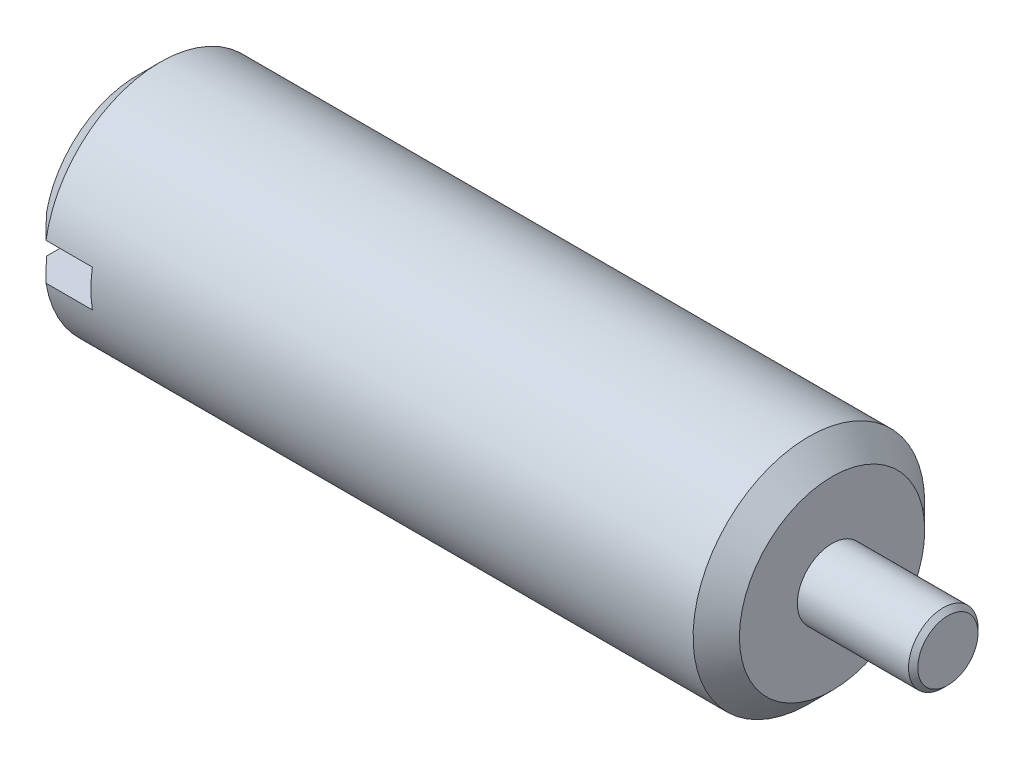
ISO-10303-21;
HEADER;
FILE_DESCRIPTION(('STEP AP214'),'2;1');
FILE_NAME('part.step','',(''),(''),'','','');
FILE_SCHEMA(('AUTOMOTIVE_DESIGN { 1 0 10303 214 1 1 1 1 }'));
ENDSEC;
DATA;
#1=APPLICATION_CONTEXT('core data for automotive mechanical design processes');
#2=APPLICATION_PROTOCOL_DEFINITION('international standard','automotive_design',2000,#1);
#3=PRODUCT_CONTEXT('',#1,'mechanical');
#4=PRODUCT('Part','Part','',(#3));
#5=PRODUCT_RELATED_PRODUCT_CATEGORY('part','',(#4));
#6=PRODUCT_DEFINITION_FORMATION('','',#4);
#7=PRODUCT_DEFINITION_CONTEXT('part definition',#1,'design');
#8=PRODUCT_DEFINITION('design','',#6,#7);
#9=PRODUCT_DEFINITION_SHAPE('','',#8);
#10=(LENGTH_UNIT() NAMED_UNIT(*) SI_UNIT(.MILLI.,.METRE.));
#11=(NAMED_UNIT(*) PLANE_ANGLE_UNIT() SI_UNIT($,.RADIAN.));
#12=(NAMED_UNIT(*) SI_UNIT($,.STERADIAN.) SOLID_ANGLE_UNIT());
#13=UNCERTAINTY_MEASURE_WITH_UNIT(LENGTH_MEASURE(1.E-05),#10,'distance_accuracy_value','');
#14=(GEOMETRIC_REPRESENTATION_CONTEXT(3) GLOBAL_UNCERTAINTY_ASSIGNED_CONTEXT((#13)) GLOBAL_UNIT_ASSIGNED_CONTEXT((#10,
#11,#12)) REPRESENTATION_CONTEXT('',''));
#15=CARTESIAN_POINT('',(0.,0.,0.));
#16=DIRECTION('',(0.,0.,1.));
#17=DIRECTION('',(1.,0.,0.));
#18=AXIS2_PLACEMENT_3D('',#15,#16,#17);
#19=CARTESIAN_POINT('',(30.,0.,0.));
#20=DIRECTION('',(1.,0.,0.));
#21=DIRECTION('',(0.,0.,-1.));
#22=AXIS2_PLACEMENT_3D('',#19,#20,#21);
#23=PLANE('',#22);
#24=CARTESIAN_POINT('',(30.,0.,0.));
#25=DIRECTION('',(1.,0.,0.));
#26=DIRECTION('',(0.,0.,-1.));
#27=AXIS2_PLACEMENT_3D('',#24,#25,#26);
#28=CIRCLE('',#27,4.);
#29=CARTESIAN_POINT('',(30.,0.,-4.00000000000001));
#30=VERTEX_POINT('',#29);
#31=EDGE_CURVE('E193',#30,#30,#28,.T.);
#32=ORIENTED_EDGE('',*,*,#31,.T.);
#33=EDGE_LOOP('',(#32));
#34=FACE_BOUND('',#33,.T.);
#35=CARTESIAN_POINT('',(30.,0.,0.));
#36=DIRECTION('',(1.,0.,0.));
#37=DIRECTION('',(0.,0.,-1.));
#38=AXIS2_PLACEMENT_3D('',#35,#36,#37);
#39=CIRCLE('',#38,1.5);
#40=CARTESIAN_POINT('',(30.,0.,-1.5));
#41=VERTEX_POINT('',#40);
#42=EDGE_CURVE('E103',#41,#41,#39,.T.);
#43=ORIENTED_EDGE('',*,*,#42,.F.);
#44=EDGE_LOOP('',(#43));
#45=FACE_BOUND('',#44,.T.);
#46=ADVANCED_FACE('F25',(#34,#45),#23,.T.);
#47=CARTESIAN_POINT('',(0.,0.,0.));
#48=DIRECTION('',(1.,0.,0.));
#49=DIRECTION('',(0.,0.,-1.));
#50=AXIS2_PLACEMENT_3D('',#47,#48,#49);
#51=PLANE('',#50);
#52=DIRECTION('',(0.,0.,1.));
#53=VECTOR('',#52,1.);
#54=CARTESIAN_POINT('',(0.,0.800000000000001,0.));
#55=LINE('',#54,#53);
#56=CARTESIAN_POINT('',(0.,0.800000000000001,-3.91918358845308));
#57=VERTEX_POINT('',#56);
#58=CARTESIAN_POINT('',(0.,0.800000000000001,3.91918358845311));
#59=VERTEX_POINT('',#58);
#60=EDGE_CURVE('E117',#57,#59,#55,.T.);
#61=ORIENTED_EDGE('',*,*,#60,.T.);
#62=CARTESIAN_POINT('',(0.,0.,0.));
#63=DIRECTION('',(1.,0.,0.));
#64=DIRECTION('',(0.,0.,-1.));
#65=AXIS2_PLACEMENT_3D('',#62,#63,#64);
#66=CIRCLE('',#65,3.99999999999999);
#67=EDGE_CURVE('E46',#59,#57,#66,.F.);
#68=ORIENTED_EDGE('',*,*,#67,.T.);
#69=EDGE_LOOP('',(#61,#68));
#70=FACE_BOUND('',#69,.T.);
#71=ADVANCED_FACE('F185',(#70),#51,.F.);
#72=CARTESIAN_POINT('',(30.,0.,0.));
#73=DIRECTION('',(-1.,0.,0.));
#74=DIRECTION('',(0.,0.,1.));
#75=AXIS2_PLACEMENT_3D('',#72,#73,#74);
#76=CYLINDRICAL_SURFACE('',#75,5.);
#77=CARTESIAN_POINT('',(29.,0.,0.));
#78=DIRECTION('',(1.,0.,0.));
#79=DIRECTION('',(0.,0.,-1.));
#80=AXIS2_PLACEMENT_3D('',#77,#78,#79);
#81=CIRCLE('',#80,5.);
#82=CARTESIAN_POINT('',(29.,0.,-5.00000000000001));
#83=VERTEX_POINT('',#82);
#84=EDGE_CURVE('E197',#83,#83,#81,.F.);
#85=ORIENTED_EDGE('',*,*,#84,.T.);
#86=EDGE_LOOP('',(#85));
#87=FACE_BOUND('',#86,.T.);
#88=DIRECTION('',(-1.,0.,0.));
#89=VECTOR('',#88,1.);
#90=CARTESIAN_POINT('',(30.,-0.800000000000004,4.93558507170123));
#91=LINE('',#90,#89);
#92=CARTESIAN_POINT('',(2.99999999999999,-0.800000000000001,4.93558507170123));
#93=VERTEX_POINT('',#92);
#94=CARTESIAN_POINT('',(1.,-0.800000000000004,4.93558507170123));
#95=VERTEX_POINT('',#94);
#96=EDGE_CURVE('E88',#93,#95,#91,.T.);
#97=ORIENTED_EDGE('',*,*,#96,.T.);
#98=CARTESIAN_POINT('',(1.,0.,0.));
#99=DIRECTION('',(1.,0.,0.));
#100=DIRECTION('',(0.,0.,-1.));
#101=AXIS2_PLACEMENT_3D('',#98,#99,#100);
#102=CIRCLE('',#101,5.);
#103=CARTESIAN_POINT('',(1.,-0.800000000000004,-4.93558507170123));
#104=VERTEX_POINT('',#103);
#105=EDGE_CURVE('E85',#95,#104,#102,.T.);
#106=ORIENTED_EDGE('',*,*,#105,.T.);
#107=DIRECTION('',(-1.,0.,0.));
#108=VECTOR('',#107,1.);
#109=CARTESIAN_POINT('',(30.,-0.800000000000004,-4.93558507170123));
#110=LINE('',#109,#108);
#111=CARTESIAN_POINT('',(3.,-0.800000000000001,-4.93558507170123));
#112=VERTEX_POINT('',#111);
#113=EDGE_CURVE('E78',#104,#112,#110,.F.);
#114=ORIENTED_EDGE('',*,*,#113,.T.);
#115=CARTESIAN_POINT('',(3.,0.,0.));
#116=DIRECTION('',(1.,0.,0.));
#117=DIRECTION('',(0.,0.,-1.));
#118=AXIS2_PLACEMENT_3D('',#115,#116,#117);
#119=CIRCLE('',#118,5.);
#120=CARTESIAN_POINT('',(3.,0.800000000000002,-4.93558507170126));
#121=VERTEX_POINT('',#120);
#122=EDGE_CURVE('E82',#112,#121,#119,.T.);
#123=ORIENTED_EDGE('',*,*,#122,.T.);
#124=DIRECTION('',(-1.,0.,0.));
#125=VECTOR('',#124,1.);
#126=CARTESIAN_POINT('',(30.,0.800000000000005,-4.93558507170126));
#127=LINE('',#126,#125);
#128=CARTESIAN_POINT('',(1.,0.800000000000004,-4.93558507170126));
#129=VERTEX_POINT('',#128);
#130=EDGE_CURVE('E112',#121,#129,#127,.T.);
#131=ORIENTED_EDGE('',*,*,#130,.T.);
#132=CARTESIAN_POINT('',(1.,0.,0.));
#133=DIRECTION('',(1.,0.,0.));
#134=DIRECTION('',(0.,0.,-1.));
#135=AXIS2_PLACEMENT_3D('',#132,#133,#134);
#136=CIRCLE('',#135,5.);
#137=CARTESIAN_POINT('',(1.,0.800000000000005,4.93558507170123));
#138=VERTEX_POINT('',#137);
#139=EDGE_CURVE('E99',#129,#138,#136,.T.);
#140=ORIENTED_EDGE('',*,*,#139,.T.);
#141=DIRECTION('',(-1.,0.,0.));
#142=VECTOR('',#141,1.);
#143=CARTESIAN_POINT('',(30.,0.800000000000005,4.93558507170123));
#144=LINE('',#143,#142);
#145=CARTESIAN_POINT('',(2.99999999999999,0.800000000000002,4.93558507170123));
#146=VERTEX_POINT('',#145);
#147=EDGE_CURVE('E110',#138,#146,#144,.F.);
#148=ORIENTED_EDGE('',*,*,#147,.T.);
#149=EDGE_CURVE('E100',#146,#93,#119,.T.);
#150=ORIENTED_EDGE('',*,*,#149,.T.);
#151=EDGE_LOOP('',(#97,#106,#114,#123,#131,#140,#148,#150));
#152=FACE_BOUND('',#151,.T.);
#153=ADVANCED_FACE('F27',(#87,#152),#76,.T.);
#154=DIRECTION('',(0.,0.,-1.));
#155=VECTOR('',#154,1.);
#156=CARTESIAN_POINT('',(0.,-0.800000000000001,0.));
#157=LINE('',#156,#155);
#158=CARTESIAN_POINT('',(0.,-0.800000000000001,3.91918358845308));
#159=VERTEX_POINT('',#158);
#160=CARTESIAN_POINT('',(0.,-0.800000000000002,-3.91918358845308));
#161=VERTEX_POINT('',#160);
#162=EDGE_CURVE('E114',#159,#161,#157,.T.);
#163=ORIENTED_EDGE('',*,*,#162,.T.);
#164=CARTESIAN_POINT('',(0.,0.,0.));
#165=DIRECTION('',(1.,0.,0.));
#166=DIRECTION('',(0.,0.,-1.));
#167=AXIS2_PLACEMENT_3D('',#164,#165,#166);
#168=CIRCLE('',#167,3.99999999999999);
#169=EDGE_CURVE('E214',#161,#159,#168,.F.);
#170=ORIENTED_EDGE('',*,*,#169,.T.);
#171=EDGE_LOOP('',(#163,#170));
#172=FACE_BOUND('',#171,.T.);
#173=ADVANCED_FACE('F146',(#172),#51,.F.);
#174=CARTESIAN_POINT('',(3.,0.800000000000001,-5.));
#175=DIRECTION('',(1.,0.,0.));
#176=DIRECTION('',(0.,0.,-1.));
#177=AXIS2_PLACEMENT_3D('',#174,#175,#176);
#178=PLANE('',#177);
#179=DIRECTION('',(0.,0.,1.));
#180=VECTOR('',#179,1.);
#181=CARTESIAN_POINT('',(3.,0.800000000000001,-5.));
#182=LINE('',#181,#180);
#183=EDGE_CURVE('E89',#121,#146,#182,.T.);
#184=ORIENTED_EDGE('',*,*,#183,.F.);
#185=ORIENTED_EDGE('',*,*,#122,.F.);
#186=DIRECTION('',(0.,0.,1.));
#187=VECTOR('',#186,1.);
#188=CARTESIAN_POINT('',(3.,-0.800000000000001,-5.00000000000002));
#189=LINE('',#188,#187);
#190=EDGE_CURVE('E96',#112,#93,#189,.T.);
#191=ORIENTED_EDGE('',*,*,#190,.T.);
#192=ORIENTED_EDGE('',*,*,#149,.F.);
#193=EDGE_LOOP('',(#184,#185,#191,#192));
#194=FACE_BOUND('',#193,.T.);
#195=ADVANCED_FACE('F94',(#194),#178,.F.);
#196=CARTESIAN_POINT('',(3.,0.800000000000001,-5.));
#197=DIRECTION('',(0.,1.,0.));
#198=DIRECTION('',(-1.,0.,0.));
#199=AXIS2_PLACEMENT_3D('',#196,#197,#198);
#200=PLANE('',#199);
#201=ORIENTED_EDGE('',*,*,#147,.F.);
#202=CARTESIAN_POINT('',(1.,0.800000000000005,4.93558507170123));
#203=CARTESIAN_POINT('',(0.916527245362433,0.800000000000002,4.85102221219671));
#204=CARTESIAN_POINT('',(0.83308161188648,0.800000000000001,4.76643256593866));
#205=CARTESIAN_POINT('',(0.666255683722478,0.800000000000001,4.59718901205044));
#206=CARTESIAN_POINT('',(0.582875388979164,0.800000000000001,4.51253510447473));
#207=CARTESIAN_POINT('',(0.416191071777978,0.800000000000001,4.34315217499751));
#208=CARTESIAN_POINT('',(0.332887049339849,0.800000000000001,4.25842315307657));
#209=CARTESIAN_POINT('',(0.166370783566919,0.800000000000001,4.08887483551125));
#210=CARTESIAN_POINT('',(0.0831585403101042,0.800000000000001,4.0040555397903));
#211=CARTESIAN_POINT('',(0.,0.800000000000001,3.91918358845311));
#212=B_SPLINE_CURVE_WITH_KNOTS('',3,(#202,#203,#204,#205,#206,#207,#208,#209,#210,#211),
.UNSPECIFIED.,.F.,.F.,(4,2,2,2,4),(0.,0.356464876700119,0.712929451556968,1.06939411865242,
1.42585908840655),.UNSPECIFIED.);
#213=EDGE_CURVE('E40',#138,#59,#212,.T.);
#214=ORIENTED_EDGE('',*,*,#213,.T.);
#215=ORIENTED_EDGE('',*,*,#60,.F.);
#216=CARTESIAN_POINT('',(0.,0.800000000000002,-3.91918358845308));
#217=CARTESIAN_POINT('',(0.0831585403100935,0.800000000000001,-4.00405553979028));
#218=CARTESIAN_POINT('',(0.166370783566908,0.800000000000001,-4.08887483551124));
#219=CARTESIAN_POINT('',(0.332887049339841,0.800000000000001,-4.25842315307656));
#220=CARTESIAN_POINT('',(0.416191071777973,0.800000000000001,-4.34315217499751));
#221=CARTESIAN_POINT('',(0.582875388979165,0.800000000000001,-4.51253510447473));
#222=CARTESIAN_POINT('',(0.666255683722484,0.800000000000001,-4.59718901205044));
#223=CARTESIAN_POINT('',(0.833081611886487,0.800000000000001,-4.76643256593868));
#224=CARTESIAN_POINT('',(0.916527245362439,0.800000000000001,-4.85102221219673));
#225=CARTESIAN_POINT('',(1.,0.800000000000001,-4.93558507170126));
#226=B_SPLINE_CURVE_WITH_KNOTS('',3,(#216,#217,#218,#219,#220,#221,#222,#223,#224,#225),
.UNSPECIFIED.,.F.,.F.,(4,2,2,2,4),(0.,0.356464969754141,0.712929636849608,1.06939421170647,
1.4258590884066),.UNSPECIFIED.);
#227=EDGE_CURVE('E149',#57,#129,#226,.T.);
#228=ORIENTED_EDGE('',*,*,#227,.T.);
#229=ORIENTED_EDGE('',*,*,#130,.F.);
#230=ORIENTED_EDGE('',*,*,#183,.T.);
#231=EDGE_LOOP('',(#201,#214,#215,#228,#229,#230));
#232=FACE_BOUND('',#231,.T.);
#233=ADVANCED_FACE('F141',(#232),#200,.F.);
#234=CARTESIAN_POINT('',(3.,-0.800000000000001,-5.00000000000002));
#235=DIRECTION('',(0.,-1.,0.));
#236=DIRECTION('',(1.,0.,0.));
#237=AXIS2_PLACEMENT_3D('',#234,#235,#236);
#238=PLANE('',#237);
#239=ORIENTED_EDGE('',*,*,#113,.F.);
#240=CARTESIAN_POINT('',(1.,-0.800000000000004,-4.93558507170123));
#241=CARTESIAN_POINT('',(0.916527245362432,-0.800000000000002,-4.85102221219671));
#242=CARTESIAN_POINT('',(0.833081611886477,-0.800000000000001,-4.76643256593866));
#243=CARTESIAN_POINT('',(0.666255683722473,-0.8,-4.59718901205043));
#244=CARTESIAN_POINT('',(0.582875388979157,-0.800000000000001,-4.51253510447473));
#245=CARTESIAN_POINT('',(0.416191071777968,-0.800000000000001,-4.3431521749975));
#246=CARTESIAN_POINT('',(0.332887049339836,-0.800000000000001,-4.25842315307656));
#247=CARTESIAN_POINT('',(0.166370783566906,-0.800000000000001,-4.08887483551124));
#248=CARTESIAN_POINT('',(0.0831585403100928,-0.800000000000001,-4.00405553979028));
#249=CARTESIAN_POINT('',(0.,-0.800000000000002,-3.91918358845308));
#250=B_SPLINE_CURVE_WITH_KNOTS('',3,(#240,#241,#242,#243,#244,#245,#246,#247,#248,#249),
.UNSPECIFIED.,.F.,.F.,(4,2,2,2,4),(0.,0.356464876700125,0.712929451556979,1.06939411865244,
1.42585908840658),.UNSPECIFIED.);
#251=EDGE_CURVE('E129',#104,#161,#250,.T.);
#252=ORIENTED_EDGE('',*,*,#251,.T.);
#253=ORIENTED_EDGE('',*,*,#162,.F.);
#254=CARTESIAN_POINT('',(0.,-0.800000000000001,3.91918358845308));
#255=CARTESIAN_POINT('',(0.0831585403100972,-0.800000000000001,4.00405553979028));
#256=CARTESIAN_POINT('',(0.16637078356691,-0.800000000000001,4.08887483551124));
#257=CARTESIAN_POINT('',(0.332887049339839,-0.800000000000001,4.25842315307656));
#258=CARTESIAN_POINT('',(0.416191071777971,-0.800000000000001,4.34315217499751));
#259=CARTESIAN_POINT('',(0.58287538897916,-0.800000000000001,4.51253510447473));
#260=CARTESIAN_POINT('',(0.666255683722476,-0.800000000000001,4.59718901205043));
#261=CARTESIAN_POINT('',(0.833081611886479,-0.800000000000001,4.76643256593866));
#262=CARTESIAN_POINT('',(0.916527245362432,-0.800000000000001,4.85102221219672));
#263=CARTESIAN_POINT('',(0.999999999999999,-0.800000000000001,4.93558507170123));
#264=B_SPLINE_CURVE_WITH_KNOTS('',3,(#254,#255,#256,#257,#258,#259,#260,#261,#262,#263),
.UNSPECIFIED.,.F.,.F.,(4,2,2,2,4),(0.,0.356464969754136,0.712929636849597,1.06939421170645,
1.42585908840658),.UNSPECIFIED.);
#265=EDGE_CURVE('E122',#159,#95,#264,.T.);
#266=ORIENTED_EDGE('',*,*,#265,.T.);
#267=ORIENTED_EDGE('',*,*,#96,.F.);
#268=ORIENTED_EDGE('',*,*,#190,.F.);
#269=EDGE_LOOP('',(#239,#252,#253,#266,#267,#268));
#270=FACE_BOUND('',#269,.T.);
#271=ADVANCED_FACE('F102',(#270),#238,.F.);
#272=CARTESIAN_POINT('',(1.,0.,0.));
#273=DIRECTION('',(1.,0.,0.));
#274=DIRECTION('',(0.,0.,-1.));
#275=AXIS2_PLACEMENT_3D('',#272,#273,#274);
#276=CONICAL_SURFACE('',#275,5.,0.785398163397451);
#277=ORIENTED_EDGE('',*,*,#265,.F.);
#278=ORIENTED_EDGE('',*,*,#169,.F.);
#279=ORIENTED_EDGE('',*,*,#251,.F.);
#280=ORIENTED_EDGE('',*,*,#105,.F.);
#281=EDGE_LOOP('',(#277,#278,#279,#280));
#282=FACE_BOUND('',#281,.T.);
#283=ADVANCED_FACE('F134',(#282),#276,.T.);
#284=CARTESIAN_POINT('',(1.,0.,0.));
#285=DIRECTION('',(1.,0.,0.));
#286=DIRECTION('',(0.,0.,-1.));
#287=AXIS2_PLACEMENT_3D('',#284,#285,#286);
#288=CONICAL_SURFACE('',#287,5.,0.785398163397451);
#289=ORIENTED_EDGE('',*,*,#227,.F.);
#290=ORIENTED_EDGE('',*,*,#67,.F.);
#291=ORIENTED_EDGE('',*,*,#213,.F.);
#292=ORIENTED_EDGE('',*,*,#139,.F.);
#293=EDGE_LOOP('',(#289,#290,#291,#292));
#294=FACE_BOUND('',#293,.T.);
#295=ADVANCED_FACE('F159',(#294),#288,.T.);
#296=CARTESIAN_POINT('',(30.,0.,0.));
#297=DIRECTION('',(-1.,0.,0.));
#298=DIRECTION('',(0.,0.,1.));
#299=AXIS2_PLACEMENT_3D('',#296,#297,#298);
#300=CONICAL_SURFACE('',#299,4.,0.785398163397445);
#301=ORIENTED_EDGE('',*,*,#84,.F.);
#302=EDGE_LOOP('',(#301));
#303=FACE_BOUND('',#302,.T.);
#304=ORIENTED_EDGE('',*,*,#31,.F.);
#305=EDGE_LOOP('',(#304));
#306=FACE_BOUND('',#305,.T.);
#307=ADVANCED_FACE('F163',(#303,#306),#300,.T.);
#308=CARTESIAN_POINT('',(35.,0.,0.));
#309=DIRECTION('',(-1.,0.,0.));
#310=DIRECTION('',(0.,0.,1.));
#311=AXIS2_PLACEMENT_3D('',#308,#309,#310);
#312=CYLINDRICAL_SURFACE('',#311,1.5);
#313=CARTESIAN_POINT('',(34.8,0.,0.));
#314=DIRECTION('',(1.,0.,0.));
#315=DIRECTION('',(0.,0.,-1.));
#316=AXIS2_PLACEMENT_3D('',#313,#314,#315);
#317=CIRCLE('',#316,1.5);
#318=CARTESIAN_POINT('',(34.8,0.,-1.5));
#319=VERTEX_POINT('',#318);
#320=EDGE_CURVE('E11',#319,#319,#317,.F.);
#321=ORIENTED_EDGE('',*,*,#320,.T.);
#322=EDGE_LOOP('',(#321));
#323=FACE_BOUND('',#322,.T.);
#324=ORIENTED_EDGE('',*,*,#42,.T.);
#325=EDGE_LOOP('',(#324));
#326=FACE_BOUND('',#325,.T.);
#327=ADVANCED_FACE('F168',(#323,#326),#312,.T.);
#328=CARTESIAN_POINT('',(35.,0.,0.));
#329=DIRECTION('',(1.,0.,0.));
#330=DIRECTION('',(0.,0.,-1.));
#331=AXIS2_PLACEMENT_3D('',#328,#329,#330);
#332=PLANE('',#331);
#333=CARTESIAN_POINT('',(35.,0.,0.));
#334=DIRECTION('',(1.,0.,0.));
#335=DIRECTION('',(0.,0.,-1.));
#336=AXIS2_PLACEMENT_3D('',#333,#334,#335);
#337=CIRCLE('',#336,1.3);
#338=CARTESIAN_POINT('',(35.,0.,-1.3));
#339=VERTEX_POINT('',#338);
#340=EDGE_CURVE('E33',#339,#339,#337,.T.);
#341=ORIENTED_EDGE('',*,*,#340,.T.);
#342=EDGE_LOOP('',(#341));
#343=FACE_BOUND('',#342,.T.);
#344=ADVANCED_FACE('F172',(#343),#332,.T.);
#345=CARTESIAN_POINT('',(35.,0.,0.));
#346=DIRECTION('',(-1.,0.,0.));
#347=DIRECTION('',(0.,0.,1.));
#348=AXIS2_PLACEMENT_3D('',#345,#346,#347);
#349=CONICAL_SURFACE('',#348,1.3,0.785398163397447);
#350=ORIENTED_EDGE('',*,*,#320,.F.);
#351=EDGE_LOOP('',(#350));
#352=FACE_BOUND('',#351,.T.);
#353=ORIENTED_EDGE('',*,*,#340,.F.);
#354=EDGE_LOOP('',(#353));
#355=FACE_BOUND('',#354,.T.);
#356=ADVANCED_FACE('F176',(#352,#355),#349,.T.);
#357=CLOSED_SHELL('',(#46,#71,#153,#173,#195,#233,#271,#283,#295,#307,#327,#344,#356));
#358=MANIFOLD_SOLID_BREP('B2',#357);
#359=ADVANCED_BREP_SHAPE_REPRESENTATION('',(#18,#358),#14);
#360=SHAPE_DEFINITION_REPRESENTATION(#9,#359);
ENDSEC;
END-ISO-10303-21;
